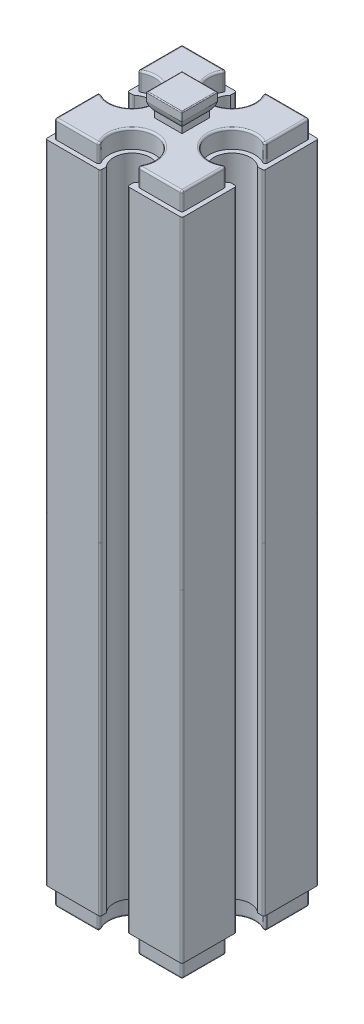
from build123d import *

# Parameters (mm, degrees)
EXTRUDE_1_DEPTH        = 35.5
EXTRUDE_2_DEPTH        = 2
EXTRUDE_3_DEPTH        = 2
FILLET_3_R             = 0.2
CUT_EXTRUDE_1_DEPTH    = 3
FILLET_4_R             = 0.2
FILLET_5_R             = 0.1
FILLET_3_OF_MIRROR_1_R = 0.2
FILLET_4_OF_MIRROR_1_R = 0.2
FILLET_5_OF_MIRROR_1_R = 0.1


with BuildPart() as part:
    # Sketch 1 → Extrude 1 (new body)
    with BuildSketch(Plane(origin=(0, 0, 0), x_dir=(1, 0, 0), z_dir=(0, 1, 0))):
        with BuildLine():
            Line((-7.5, 7.5), (-1.5, 7.5))
            Line((-1.5, 7.5), (-1.5, 6.822875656))
            ThreePointArc((-1.5, 6.822875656), (0, 3.5), (1.5, 6.822875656))
            Line((1.5, 6.822875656), (1.5, 7.5))
            Line((1.5, 7.5), (7.5, 7.5))
            Line((7.5, 7.5), (7.5, 1.5))
            Line((7.5, 1.5), (6.822875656, 1.5))
            ThreePointArc((6.822875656, 1.5), (3.5, 0), (6.822875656, -1.5))
            Line((6.822875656, -1.5), (7.5, -1.5))
            Line((7.5, -1.5), (7.5, -7.5))
            Line((7.5, -7.5), (1.5, -7.5))
            Line((1.5, -7.5), (1.5, -6.822875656))
            ThreePointArc((1.5, -6.822875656), (0, -3.5), (-1.5, -6.822875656))
            Line((-1.5, -6.822875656), (-1.5, -7.5))
            Line((-1.5, -7.5), (-7.5, -7.5))
            Line((-7.5, -7.5), (-7.5, -1.5))
            Line((-7.5, -1.5), (-6.822875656, -1.5))
            ThreePointArc((-6.822875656, -1.5), (-3.5, 0), (-6.822875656, 1.5))
            Line((-6.822875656, 1.5), (-7.5, 1.5))
            Line((-7.5, 1.5), (-7.5, 7.5))
        make_face()
    extrude_1 = extrude(amount=EXTRUDE_1_DEPTH)

    # Sketch 2 → Extrude 2 (add)
    with BuildSketch(Plane(origin=(0, 35.5, 0), x_dir=(1, 0, 0), z_dir=(0, 1, 0))):
        with BuildLine():
            Line((-7, 7), (-7, 2))
            ThreePointArc((-7, 2), (-3, 0), (-7, -2))
            Line((-7, -2), (-7, -7))
            Line((-7, -7), (-2, -7))
            ThreePointArc((-2, -7), (0, -3), (2, -7))
            Line((2, -7), (7, -7))
            Line((7, -7), (7, -2))
            ThreePointArc((7, -2), (3, 0), (7, 2))
            Line((7, 2), (7, 7))
            Line((7, 7), (2, 7))
            ThreePointArc((2, 7), (0, 3), (-2, 7))
            Line((-2, 7), (-7, 7))
        make_face()
    extrude_2 = extrude(amount=EXTRUDE_2_DEPTH)

    # Sketch 3 → Extrude 3 (add, symmetric)
    with BuildSketch(Plane(origin=(0, 0, 0), x_dir=(0, 0, -1), z_dir=(1, 0, 0))):
        with BuildLine():
            Line((-1.5, 37.5), (1.5, 37.5))
            Line((1.5, 37.5), (1.5, 38.177124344))
            ThreePointArc((1.5, 38.177124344), (1.780042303, 38.588161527), (1.95, 39.055590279))
            Line((1.95, 39.055590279), (1.95, 40))
            Line((1.95, 40), (-1.95, 40))
            Line((-1.95, 40), (-1.95, 39.055590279))
            ThreePointArc((-1.95, 39.055590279), (-1.780042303, 38.588161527), (-1.5, 38.177124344))
            Line((-1.5, 38.177124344), (-1.5, 37.5))
        make_face()
    extrude_3 = extrude(amount=EXTRUDE_3_DEPTH, both=True)

    # Fillet 3
    fillet_3_edges = [part.edges().sort_by_distance(p)[0] for p in [
        (-7.5, 17.75, -7.5),
        (-1.5, 17.75, -7.5),
        (1.5, 17.75, -7.5),
        (7.5, 17.75, -7.5),
        (7.5, 17.75, -1.5),
        (7.5, 17.75, 1.5),
        (7.5, 17.75, 7.5),
        (1.5, 17.75, 7.5),
        (-1.5, 17.75, 7.5),
        (-7.5, 17.75, 7.5),
        (-7.5, 17.75, 1.5),
        (-6.822875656, 17.75, -1.5),
        (-7.5, 17.75, -1.5),
    ]]
    fillet(fillet_3_edges, radius=FILLET_3_R)

    # Sketch 4 → Cut-Extrude 1 (cut, symmetric)
    with BuildSketch(Plane.XY):
        with BuildLine():
            Line((1.95, 40), (2, 40))
            Line((2, 40), (2, 37.5))
            Line((2, 37.5), (1.5, 37.5))
            Line((1.5, 37.5), (1.5, 38.177124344))
            ThreePointArc((1.5, 38.177124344), (1.780042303, 38.588161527), (1.95, 39.055590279))
            Line((1.95, 39.055590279), (1.95, 40))
        make_face()
        with BuildLine():
            Line((-1.95, 40), (-1.95, 39.055590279))
            ThreePointArc((-1.95, 39.055590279), (-1.780042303, 38.588161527), (-1.5, 38.177124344))
            Line((-1.5, 38.177124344), (-1.5, 37.5))
            Line((-1.5, 37.5), (-2, 37.5))
            Line((-2, 37.5), (-2, 40))
            Line((-2, 40), (-1.95, 40))
        make_face()
    cut_extrude_1 = extrude(amount=CUT_EXTRUDE_1_DEPTH, both=True, mode=Mode.SUBTRACT)

    # Fillet 4
    fillet_4_edges = [part.edges().sort_by_distance(p)[0] for p in [
        (-2, 36.5, -7),
        (-7, 36.5, -7),
        (-7, 36.5, -2),
        (-7, 36.5, 2),
        (-7, 36.5, 7),
        (-2, 36.5, 7),
        (2, 36.5, 7),
        (7, 36.5, 7),
        (7, 36.5, 2),
        (7, 36.5, -2),
        (7, 36.5, -7),
        (2, 36.5, -7),
        (-4.5, 37.5, -7),
        (-7, 37.5, -4.5),
        (-3, 37.5, 0),
        (-7, 37.5, 4.5),
        (-4.5, 37.5, 7),
        (0, 37.5, 3),
        (4.5, 37.5, 7),
        (7, 37.5, 4.5),
        (3, 37.5, 0),
        (7, 37.5, -4.5),
        (4.5, 37.5, -7),
        (0, 37.5, -3),
    ]]
    fillet(fillet_4_edges, radius=FILLET_4_R)

    # Fillet 5
    fillet_5_edges = [part.edges().sort_by_distance(p)[0] for p in [
        (1.95, 40, 0),
        (0, 40, -1.95),
        (0, 40, 1.95),
        (-1.95, 40, 0),
    ]]
    fillet(fillet_5_edges, radius=FILLET_5_R)


with BuildPart() as mirror_1_1:
    # Mirror 1: Extrude 1, Extrude 2, Extrude 3 across Top Plane
    add(extrude_1.mirror(Plane(origin=(0, 0, 0), x_dir=(1, 0, 0), z_dir=(0, 1, 0))))
    add(extrude_2.mirror(Plane(origin=(0, 0, 0), x_dir=(1, 0, 0), z_dir=(0, 1, 0))))
    add(extrude_3.mirror(Plane(origin=(0, 0, 0), x_dir=(1, 0, 0), z_dir=(0, 1, 0))))

    # Mirror 1 2: Cut-Extrude 1 across Top Plane
    add(cut_extrude_1.mirror(Plane(origin=(0, 0, 0), x_dir=(1, 0, 0), z_dir=(0, 1, 0))), mode=Mode.SUBTRACT)

    # Fillet 3 of Mirror 1
    fillet_3_of_mirror_1_edges = [mirror_1_1.edges().sort_by_distance(p)[0] for p in [
        (-7.5, -17.75, -7.5),
        (-1.5, -17.75, -7.5),
        (1.5, -17.75, -7.5),
        (7.5, -17.75, -7.5),
        (7.5, -17.75, -1.5),
        (7.5, -17.75, 1.5),
        (7.5, -17.75, 7.5),
        (1.5, -17.75, 7.5),
        (-1.5, -17.75, 7.5),
        (-7.5, -17.75, 7.5),
        (-7.5, -17.75, 1.5),
        (-6.822875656, -17.75, -1.5),
        (-7.5, -17.75, -1.5),
    ]]
    fillet(fillet_3_of_mirror_1_edges, radius=FILLET_3_OF_MIRROR_1_R)

    # Fillet 4 of Mirror 1
    fillet_4_of_mirror_1_edges = [mirror_1_1.edges().sort_by_distance(p)[0] for p in [
        (-2, -36.5, -7),
        (-7, -36.5, -7),
        (-7, -36.5, -2),
        (-7, -36.5, 2),
        (-7, -36.5, 7),
        (-2, -36.5, 7),
        (2, -36.5, 7),
        (7, -36.5, 7),
        (7, -36.5, 2),
        (7, -36.5, -2),
        (7, -36.5, -7),
        (2, -36.5, -7),
        (-4.5, -37.5, -7),
        (-7, -37.5, -4.5),
        (-3, -37.5, 0),
        (-7, -37.5, 4.5),
        (-4.5, -37.5, 7),
        (0, -37.5, 3),
        (4.5, -37.5, 7),
        (7, -37.5, 4.5),
        (3, -37.5, 0),
        (7, -37.5, -4.5),
        (4.5, -37.5, -7),
        (0, -37.5, -3),
    ]]
    fillet(fillet_4_of_mirror_1_edges, radius=FILLET_4_OF_MIRROR_1_R)

    # Fillet 5 of Mirror 1
    fillet_5_of_mirror_1_edges = [mirror_1_1.edges().sort_by_distance(p)[0] for p in [
        (1.95, -40, 0),
        (0, -40, -1.95),
        (0, -40, 1.95),
        (-1.95, -40, 0),
    ]]
    fillet(fillet_5_of_mirror_1_edges, radius=FILLET_5_OF_MIRROR_1_R)


with BuildPart() as part_1:
    add(part.part)

    # Mirror 1 united with what the copies tou: union Mirror 1_1
    add(mirror_1_1.part)


solid = part_1.part
